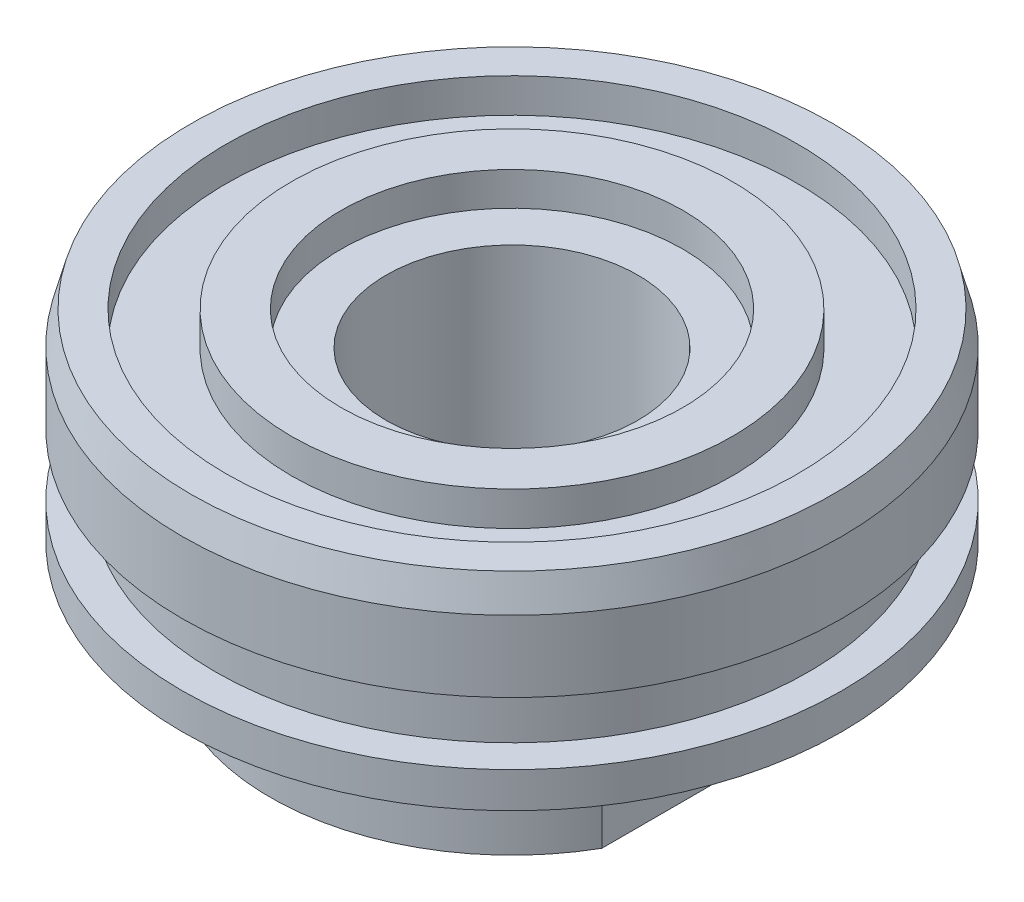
ISO-10303-21;
HEADER;
FILE_DESCRIPTION(('STEP AP214'),'2;1');
FILE_NAME('part.step','',(''),(''),'','','');
FILE_SCHEMA(('AUTOMOTIVE_DESIGN { 1 0 10303 214 1 1 1 1 }'));
ENDSEC;
DATA;
#1=APPLICATION_CONTEXT('core data for automotive mechanical design processes');
#2=APPLICATION_PROTOCOL_DEFINITION('international standard','automotive_design',2000,#1);
#3=PRODUCT_CONTEXT('',#1,'mechanical');
#4=PRODUCT('Part','Part','',(#3));
#5=PRODUCT_RELATED_PRODUCT_CATEGORY('part','',(#4));
#6=PRODUCT_DEFINITION_FORMATION('','',#4);
#7=PRODUCT_DEFINITION_CONTEXT('part definition',#1,'design');
#8=PRODUCT_DEFINITION('design','',#6,#7);
#9=PRODUCT_DEFINITION_SHAPE('','',#8);
#10=(LENGTH_UNIT() NAMED_UNIT(*) SI_UNIT(.MILLI.,.METRE.));
#11=(NAMED_UNIT(*) PLANE_ANGLE_UNIT() SI_UNIT($,.RADIAN.));
#12=(NAMED_UNIT(*) SI_UNIT($,.STERADIAN.) SOLID_ANGLE_UNIT());
#13=UNCERTAINTY_MEASURE_WITH_UNIT(LENGTH_MEASURE(1.E-05),#10,'distance_accuracy_value','');
#14=(GEOMETRIC_REPRESENTATION_CONTEXT(3) GLOBAL_UNCERTAINTY_ASSIGNED_CONTEXT((#13)) GLOBAL_UNIT_ASSIGNED_CONTEXT((#10,
#11,#12)) REPRESENTATION_CONTEXT('',''));
#15=CARTESIAN_POINT('',(0.,0.,0.));
#16=DIRECTION('',(0.,0.,1.));
#17=DIRECTION('',(1.,0.,0.));
#18=AXIS2_PLACEMENT_3D('',#15,#16,#17);
#19=CARTESIAN_POINT('',(0.,11.43,0.));
#20=DIRECTION('',(0.,-1.,0.));
#21=DIRECTION('',(0.,0.,-1.));
#22=AXIS2_PLACEMENT_3D('',#19,#20,#21);
#23=CYLINDRICAL_SURFACE('',#22,12.4714);
#24=CARTESIAN_POINT('',(0.,3.81,0.));
#25=DIRECTION('',(0.,-1.,0.));
#26=DIRECTION('',(0.,0.,-1.));
#27=AXIS2_PLACEMENT_3D('',#24,#25,#26);
#28=CIRCLE('',#27,12.4714);
#29=CARTESIAN_POINT('',(0.,3.81,-12.4714));
#30=VERTEX_POINT('',#29);
#31=EDGE_CURVE('E108',#30,#30,#28,.T.);
#32=ORIENTED_EDGE('',*,*,#31,.F.);
#33=EDGE_LOOP('',(#32));
#34=FACE_BOUND('',#33,.T.);
#35=CARTESIAN_POINT('',(0.,5.1562,0.));
#36=DIRECTION('',(0.,1.,0.));
#37=DIRECTION('',(0.,0.,1.));
#38=AXIS2_PLACEMENT_3D('',#35,#36,#37);
#39=CIRCLE('',#38,12.4714);
#40=CARTESIAN_POINT('',(0.,5.1562,12.4714));
#41=VERTEX_POINT('',#40);
#42=EDGE_CURVE('E36',#41,#41,#39,.T.);
#43=ORIENTED_EDGE('',*,*,#42,.F.);
#44=EDGE_LOOP('',(#43));
#45=FACE_BOUND('',#44,.T.);
#46=ADVANCED_FACE('F32',(#34,#45),#23,.T.);
#47=CARTESIAN_POINT('',(0.,0.,0.));
#48=DIRECTION('',(0.,1.,0.));
#49=DIRECTION('',(0.,0.,1.));
#50=AXIS2_PLACEMENT_3D('',#47,#48,#49);
#51=PLANE('',#50);
#52=CARTESIAN_POINT('',(0.,0.,0.));
#53=DIRECTION('',(0.,1.,0.));
#54=DIRECTION('',(0.,0.,1.));
#55=AXIS2_PLACEMENT_3D('',#52,#53,#54);
#56=CIRCLE('',#55,4.7625);
#57=CARTESIAN_POINT('',(0.,0.,4.7625));
#58=VERTEX_POINT('',#57);
#59=EDGE_CURVE('E131',#58,#58,#56,.T.);
#60=ORIENTED_EDGE('',*,*,#59,.T.);
#61=EDGE_LOOP('',(#60));
#62=FACE_BOUND('',#61,.T.);
#63=CARTESIAN_POINT('',(0.,0.,0.));
#64=DIRECTION('',(0.,-1.,0.));
#65=DIRECTION('',(0.,0.,-1.));
#66=AXIS2_PLACEMENT_3D('',#63,#64,#65);
#67=CIRCLE('',#66,9.144);
#68=CARTESIAN_POINT('',(-7.9375,0.,-4.53969489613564));
#69=VERTEX_POINT('',#68);
#70=CARTESIAN_POINT('',(7.9375,0.,-4.53969489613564));
#71=VERTEX_POINT('',#70);
#72=EDGE_CURVE('E95',#69,#71,#67,.T.);
#73=ORIENTED_EDGE('',*,*,#72,.T.);
#74=DIRECTION('',(0.,0.,1.));
#75=VECTOR('',#74,1.);
#76=CARTESIAN_POINT('',(7.9375,0.,0.));
#77=LINE('',#76,#75);
#78=CARTESIAN_POINT('',(7.9375,0.,4.53969489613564));
#79=VERTEX_POINT('',#78);
#80=EDGE_CURVE('E93',#71,#79,#77,.T.);
#81=ORIENTED_EDGE('',*,*,#80,.T.);
#82=CARTESIAN_POINT('',(0.,0.,0.));
#83=DIRECTION('',(0.,-1.,0.));
#84=DIRECTION('',(0.,0.,-1.));
#85=AXIS2_PLACEMENT_3D('',#82,#83,#84);
#86=CIRCLE('',#85,9.144);
#87=CARTESIAN_POINT('',(-7.9375,0.,4.53969489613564));
#88=VERTEX_POINT('',#87);
#89=EDGE_CURVE('E49',#79,#88,#86,.T.);
#90=ORIENTED_EDGE('',*,*,#89,.T.);
#91=DIRECTION('',(0.,0.,-1.));
#92=VECTOR('',#91,1.);
#93=CARTESIAN_POINT('',(-7.9375,0.,0.));
#94=LINE('',#93,#92);
#95=EDGE_CURVE('E83',#88,#69,#94,.T.);
#96=ORIENTED_EDGE('',*,*,#95,.T.);
#97=EDGE_LOOP('',(#73,#81,#90,#96));
#98=FACE_BOUND('',#97,.T.);
#99=ADVANCED_FACE('F91',(#62,#98),#51,.F.);
#100=CARTESIAN_POINT('',(0.,7.5184,0.));
#101=DIRECTION('',(0.,1.,0.));
#102=DIRECTION('',(0.,0.,1.));
#103=AXIS2_PLACEMENT_3D('',#100,#101,#102);
#104=CIRCLE('',#103,12.4714);
#105=CARTESIAN_POINT('',(0.,7.5184,12.4714));
#106=VERTEX_POINT('',#105);
#107=EDGE_CURVE('E139',#106,#106,#104,.T.);
#108=ORIENTED_EDGE('',*,*,#107,.T.);
#109=EDGE_LOOP('',(#108));
#110=FACE_BOUND('',#109,.T.);
#111=CARTESIAN_POINT('',(0.,10.2108,0.));
#112=DIRECTION('',(0.,1.,0.));
#113=DIRECTION('',(0.,0.,1.));
#114=AXIS2_PLACEMENT_3D('',#111,#112,#113);
#115=CIRCLE('',#114,12.4714);
#116=CARTESIAN_POINT('',(0.,10.2108,12.4714));
#117=VERTEX_POINT('',#116);
#118=EDGE_CURVE('E12',#117,#117,#115,.F.);
#119=ORIENTED_EDGE('',*,*,#118,.T.);
#120=EDGE_LOOP('',(#119));
#121=FACE_BOUND('',#120,.T.);
#122=ADVANCED_FACE('F34',(#110,#121),#23,.T.);
#123=CARTESIAN_POINT('',(0.,11.43,0.));
#124=DIRECTION('',(0.,-1.,0.));
#125=DIRECTION('',(0.,0.,-1.));
#126=AXIS2_PLACEMENT_3D('',#123,#124,#125);
#127=CYLINDRICAL_SURFACE('',#126,4.7625);
#128=ORIENTED_EDGE('',*,*,#59,.F.);
#129=EDGE_LOOP('',(#128));
#130=FACE_BOUND('',#129,.T.);
#131=CARTESIAN_POINT('',(0.,10.16,0.));
#132=DIRECTION('',(0.,1.,0.));
#133=DIRECTION('',(0.,0.,1.));
#134=AXIS2_PLACEMENT_3D('',#131,#132,#133);
#135=CIRCLE('',#134,4.7625);
#136=CARTESIAN_POINT('',(0.,10.16,4.7625));
#137=VERTEX_POINT('',#136);
#138=EDGE_CURVE('E118',#137,#137,#135,.T.);
#139=ORIENTED_EDGE('',*,*,#138,.T.);
#140=EDGE_LOOP('',(#139));
#141=FACE_BOUND('',#140,.T.);
#142=ADVANCED_FACE('F213',(#130,#141),#127,.F.);
#143=CARTESIAN_POINT('',(0.,11.43,0.));
#144=DIRECTION('',(0.,1.,0.));
#145=DIRECTION('',(0.,0.,1.));
#146=AXIS2_PLACEMENT_3D('',#143,#144,#145);
#147=PLANE('',#146);
#148=CARTESIAN_POINT('',(0.,11.43,0.));
#149=DIRECTION('',(0.,1.,0.));
#150=DIRECTION('',(0.,0.,1.));
#151=AXIS2_PLACEMENT_3D('',#148,#149,#150);
#152=CIRCLE('',#151,6.4643);
#153=CARTESIAN_POINT('',(0.,11.43,6.4643));
#154=VERTEX_POINT('',#153);
#155=EDGE_CURVE('E112',#154,#154,#152,.T.);
#156=ORIENTED_EDGE('',*,*,#155,.F.);
#157=EDGE_LOOP('',(#156));
#158=FACE_BOUND('',#157,.T.);
#159=CARTESIAN_POINT('',(0.,11.43,0.));
#160=DIRECTION('',(0.,1.,0.));
#161=DIRECTION('',(0.,0.,1.));
#162=AXIS2_PLACEMENT_3D('',#159,#160,#161);
#163=CIRCLE('',#162,8.3439);
#164=CARTESIAN_POINT('',(0.,11.43,8.3439));
#165=VERTEX_POINT('',#164);
#166=EDGE_CURVE('E119',#165,#165,#163,.T.);
#167=ORIENTED_EDGE('',*,*,#166,.T.);
#168=EDGE_LOOP('',(#167));
#169=FACE_BOUND('',#168,.T.);
#170=ADVANCED_FACE('F216',(#158,#169),#147,.T.);
#171=CARTESIAN_POINT('',(0.,11.43,0.));
#172=DIRECTION('',(0.,1.,0.));
#173=DIRECTION('',(0.,0.,1.));
#174=AXIS2_PLACEMENT_3D('',#171,#172,#173);
#175=CIRCLE('',#174,12.144716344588);
#176=CARTESIAN_POINT('',(0.,11.43,12.144716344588));
#177=VERTEX_POINT('',#176);
#178=EDGE_CURVE('E41',#177,#177,#175,.T.);
#179=ORIENTED_EDGE('',*,*,#178,.T.);
#180=EDGE_LOOP('',(#179));
#181=FACE_BOUND('',#180,.T.);
#182=CARTESIAN_POINT('',(0.,11.43,0.));
#183=DIRECTION('',(0.,1.,0.));
#184=DIRECTION('',(0.,0.,1.));
#185=AXIS2_PLACEMENT_3D('',#182,#183,#184);
#186=CIRCLE('',#185,10.8077);
#187=CARTESIAN_POINT('',(0.,11.43,10.8077));
#188=VERTEX_POINT('',#187);
#189=EDGE_CURVE('E125',#188,#188,#186,.T.);
#190=ORIENTED_EDGE('',*,*,#189,.F.);
#191=EDGE_LOOP('',(#190));
#192=FACE_BOUND('',#191,.T.);
#193=ADVANCED_FACE('F211',(#181,#192),#147,.T.);
#194=CARTESIAN_POINT('',(0.,10.1346,0.));
#195=DIRECTION('',(0.,1.,0.));
#196=DIRECTION('',(0.,0.,1.));
#197=AXIS2_PLACEMENT_3D('',#194,#195,#196);
#198=CYLINDRICAL_SURFACE('',#197,10.8077);
#199=CARTESIAN_POINT('',(0.,10.1346,0.));
#200=DIRECTION('',(0.,1.,0.));
#201=DIRECTION('',(0.,0.,1.));
#202=AXIS2_PLACEMENT_3D('',#199,#200,#201);
#203=CIRCLE('',#202,10.8077);
#204=CARTESIAN_POINT('',(0.,10.1346,10.8077));
#205=VERTEX_POINT('',#204);
#206=EDGE_CURVE('E128',#205,#205,#203,.T.);
#207=ORIENTED_EDGE('',*,*,#206,.F.);
#208=EDGE_LOOP('',(#207));
#209=FACE_BOUND('',#208,.T.);
#210=ORIENTED_EDGE('',*,*,#189,.T.);
#211=EDGE_LOOP('',(#210));
#212=FACE_BOUND('',#211,.T.);
#213=ADVANCED_FACE('F207',(#209,#212),#198,.F.);
#214=CARTESIAN_POINT('',(0.,10.1346,0.));
#215=DIRECTION('',(0.,1.,0.));
#216=DIRECTION('',(0.,0.,1.));
#217=AXIS2_PLACEMENT_3D('',#214,#215,#216);
#218=PLANE('',#217);
#219=CARTESIAN_POINT('',(0.,10.1346,0.));
#220=DIRECTION('',(0.,1.,0.));
#221=DIRECTION('',(0.,0.,1.));
#222=AXIS2_PLACEMENT_3D('',#219,#220,#221);
#223=CIRCLE('',#222,8.3439);
#224=CARTESIAN_POINT('',(0.,10.1346,8.3439));
#225=VERTEX_POINT('',#224);
#226=EDGE_CURVE('E122',#225,#225,#223,.T.);
#227=ORIENTED_EDGE('',*,*,#226,.F.);
#228=EDGE_LOOP('',(#227));
#229=FACE_BOUND('',#228,.T.);
#230=ORIENTED_EDGE('',*,*,#206,.T.);
#231=EDGE_LOOP('',(#230));
#232=FACE_BOUND('',#231,.T.);
#233=ADVANCED_FACE('F203',(#229,#232),#218,.T.);
#234=CARTESIAN_POINT('',(0.,10.1346,0.));
#235=DIRECTION('',(0.,1.,0.));
#236=DIRECTION('',(0.,0.,1.));
#237=AXIS2_PLACEMENT_3D('',#234,#235,#236);
#238=CYLINDRICAL_SURFACE('',#237,8.3439);
#239=ORIENTED_EDGE('',*,*,#226,.T.);
#240=EDGE_LOOP('',(#239));
#241=FACE_BOUND('',#240,.T.);
#242=ORIENTED_EDGE('',*,*,#166,.F.);
#243=EDGE_LOOP('',(#242));
#244=FACE_BOUND('',#243,.T.);
#245=ADVANCED_FACE('F199',(#241,#244),#238,.T.);
#246=CARTESIAN_POINT('',(0.,10.16,0.));
#247=DIRECTION('',(0.,1.,0.));
#248=DIRECTION('',(0.,0.,1.));
#249=AXIS2_PLACEMENT_3D('',#246,#247,#248);
#250=CYLINDRICAL_SURFACE('',#249,6.4643);
#251=CARTESIAN_POINT('',(0.,10.16,0.));
#252=DIRECTION('',(0.,1.,0.));
#253=DIRECTION('',(0.,0.,1.));
#254=AXIS2_PLACEMENT_3D('',#251,#252,#253);
#255=CIRCLE('',#254,6.4643);
#256=CARTESIAN_POINT('',(0.,10.16,6.4643));
#257=VERTEX_POINT('',#256);
#258=EDGE_CURVE('E115',#257,#257,#255,.T.);
#259=ORIENTED_EDGE('',*,*,#258,.F.);
#260=EDGE_LOOP('',(#259));
#261=FACE_BOUND('',#260,.T.);
#262=ORIENTED_EDGE('',*,*,#155,.T.);
#263=EDGE_LOOP('',(#262));
#264=FACE_BOUND('',#263,.T.);
#265=ADVANCED_FACE('F195',(#261,#264),#250,.F.);
#266=CARTESIAN_POINT('',(0.,10.16,0.));
#267=DIRECTION('',(0.,1.,0.));
#268=DIRECTION('',(0.,0.,1.));
#269=AXIS2_PLACEMENT_3D('',#266,#267,#268);
#270=PLANE('',#269);
#271=ORIENTED_EDGE('',*,*,#138,.F.);
#272=EDGE_LOOP('',(#271));
#273=FACE_BOUND('',#272,.T.);
#274=ORIENTED_EDGE('',*,*,#258,.T.);
#275=EDGE_LOOP('',(#274));
#276=FACE_BOUND('',#275,.T.);
#277=ADVANCED_FACE('F191',(#273,#276),#270,.T.);
#278=CARTESIAN_POINT('',(0.,11.43,0.));
#279=DIRECTION('',(0.,-1.,0.));
#280=DIRECTION('',(0.,0.,-1.));
#281=AXIS2_PLACEMENT_3D('',#278,#279,#280);
#282=CONICAL_SURFACE('',#281,12.144716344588,0.261799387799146);
#283=ORIENTED_EDGE('',*,*,#118,.F.);
#284=EDGE_LOOP('',(#283));
#285=FACE_BOUND('',#284,.T.);
#286=ORIENTED_EDGE('',*,*,#178,.F.);
#287=EDGE_LOOP('',(#286));
#288=FACE_BOUND('',#287,.T.);
#289=ADVANCED_FACE('F160',(#285,#288),#282,.T.);
#290=CARTESIAN_POINT('',(0.,3.81,0.));
#291=DIRECTION('',(0.,-1.,0.));
#292=DIRECTION('',(0.,0.,-1.));
#293=AXIS2_PLACEMENT_3D('',#290,#291,#292);
#294=PLANE('',#293);
#295=DIRECTION('',(0.,0.,-1.));
#296=VECTOR('',#295,1.);
#297=CARTESIAN_POINT('',(-7.9375,3.81,0.));
#298=LINE('',#297,#296);
#299=CARTESIAN_POINT('',(-7.9375,3.81,4.53969489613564));
#300=VERTEX_POINT('',#299);
#301=CARTESIAN_POINT('',(-7.9375,3.81,-4.53969489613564));
#302=VERTEX_POINT('',#301);
#303=EDGE_CURVE('E105',#300,#302,#298,.T.);
#304=ORIENTED_EDGE('',*,*,#303,.F.);
#305=CARTESIAN_POINT('',(0.,3.81,0.));
#306=DIRECTION('',(0.,-1.,0.));
#307=DIRECTION('',(0.,0.,-1.));
#308=AXIS2_PLACEMENT_3D('',#305,#306,#307);
#309=CIRCLE('',#308,9.144);
#310=CARTESIAN_POINT('',(7.9375,3.81,4.53969489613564));
#311=VERTEX_POINT('',#310);
#312=EDGE_CURVE('E57',#311,#300,#309,.T.);
#313=ORIENTED_EDGE('',*,*,#312,.F.);
#314=DIRECTION('',(0.,0.,1.));
#315=VECTOR('',#314,1.);
#316=CARTESIAN_POINT('',(7.9375,3.81,0.));
#317=LINE('',#316,#315);
#318=CARTESIAN_POINT('',(7.9375,3.81,-4.53969489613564));
#319=VERTEX_POINT('',#318);
#320=EDGE_CURVE('E101',#319,#311,#317,.T.);
#321=ORIENTED_EDGE('',*,*,#320,.F.);
#322=CARTESIAN_POINT('',(0.,3.81,0.));
#323=DIRECTION('',(0.,-1.,0.));
#324=DIRECTION('',(0.,0.,-1.));
#325=AXIS2_PLACEMENT_3D('',#322,#323,#324);
#326=CIRCLE('',#325,9.144);
#327=EDGE_CURVE('E88',#302,#319,#326,.T.);
#328=ORIENTED_EDGE('',*,*,#327,.F.);
#329=EDGE_LOOP('',(#304,#313,#321,#328));
#330=FACE_BOUND('',#329,.T.);
#331=ORIENTED_EDGE('',*,*,#31,.T.);
#332=EDGE_LOOP('',(#331));
#333=FACE_BOUND('',#332,.T.);
#334=ADVANCED_FACE('F157',(#330,#333),#294,.T.);
#335=CARTESIAN_POINT('',(0.,3.81,0.));
#336=DIRECTION('',(0.,-1.,0.));
#337=DIRECTION('',(0.,0.,-1.));
#338=AXIS2_PLACEMENT_3D('',#335,#336,#337);
#339=CYLINDRICAL_SURFACE('',#338,9.144);
#340=ORIENTED_EDGE('',*,*,#72,.F.);
#341=DIRECTION('',(0.,-1.,0.));
#342=VECTOR('',#341,1.);
#343=CARTESIAN_POINT('',(-7.9375,3.81,-4.53969489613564));
#344=LINE('',#343,#342);
#345=EDGE_CURVE('E79',#302,#69,#344,.T.);
#346=ORIENTED_EDGE('',*,*,#345,.F.);
#347=ORIENTED_EDGE('',*,*,#327,.T.);
#348=DIRECTION('',(0.,-1.,0.));
#349=VECTOR('',#348,1.);
#350=CARTESIAN_POINT('',(7.9375,3.81,-4.53969489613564));
#351=LINE('',#350,#349);
#352=EDGE_CURVE('E107',#319,#71,#351,.T.);
#353=ORIENTED_EDGE('',*,*,#352,.T.);
#354=EDGE_LOOP('',(#340,#346,#347,#353));
#355=FACE_BOUND('',#354,.T.);
#356=ADVANCED_FACE('F153',(#355),#339,.T.);
#357=CARTESIAN_POINT('',(-7.9375,3.81,0.));
#358=DIRECTION('',(-1.,0.,0.));
#359=DIRECTION('',(0.,0.,1.));
#360=AXIS2_PLACEMENT_3D('',#357,#358,#359);
#361=PLANE('',#360);
#362=ORIENTED_EDGE('',*,*,#95,.F.);
#363=DIRECTION('',(0.,-1.,0.));
#364=VECTOR('',#363,1.);
#365=CARTESIAN_POINT('',(-7.9375,3.81,4.53969489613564));
#366=LINE('',#365,#364);
#367=EDGE_CURVE('E74',#300,#88,#366,.T.);
#368=ORIENTED_EDGE('',*,*,#367,.F.);
#369=ORIENTED_EDGE('',*,*,#303,.T.);
#370=ORIENTED_EDGE('',*,*,#345,.T.);
#371=EDGE_LOOP('',(#362,#368,#369,#370));
#372=FACE_BOUND('',#371,.T.);
#373=ADVANCED_FACE('F84',(#372),#361,.T.);
#374=CARTESIAN_POINT('',(0.,3.81,0.));
#375=DIRECTION('',(0.,-1.,0.));
#376=DIRECTION('',(0.,0.,-1.));
#377=AXIS2_PLACEMENT_3D('',#374,#375,#376);
#378=CYLINDRICAL_SURFACE('',#377,9.144);
#379=ORIENTED_EDGE('',*,*,#89,.F.);
#380=DIRECTION('',(0.,-1.,0.));
#381=VECTOR('',#380,1.);
#382=CARTESIAN_POINT('',(7.9375,3.81,4.53969489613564));
#383=LINE('',#382,#381);
#384=EDGE_CURVE('E80',#311,#79,#383,.T.);
#385=ORIENTED_EDGE('',*,*,#384,.F.);
#386=ORIENTED_EDGE('',*,*,#312,.T.);
#387=ORIENTED_EDGE('',*,*,#367,.T.);
#388=EDGE_LOOP('',(#379,#385,#386,#387));
#389=FACE_BOUND('',#388,.T.);
#390=ADVANCED_FACE('F76',(#389),#378,.T.);
#391=CARTESIAN_POINT('',(7.9375,3.81,0.));
#392=DIRECTION('',(1.,0.,0.));
#393=DIRECTION('',(0.,0.,-1.));
#394=AXIS2_PLACEMENT_3D('',#391,#392,#393);
#395=PLANE('',#394);
#396=ORIENTED_EDGE('',*,*,#80,.F.);
#397=ORIENTED_EDGE('',*,*,#352,.F.);
#398=ORIENTED_EDGE('',*,*,#320,.T.);
#399=ORIENTED_EDGE('',*,*,#384,.T.);
#400=EDGE_LOOP('',(#396,#397,#398,#399));
#401=FACE_BOUND('',#400,.T.);
#402=ADVANCED_FACE('F156',(#401),#395,.T.);
#403=CARTESIAN_POINT('',(0.,5.1562,0.));
#404=DIRECTION('',(0.,1.,0.));
#405=DIRECTION('',(0.,0.,1.));
#406=AXIS2_PLACEMENT_3D('',#403,#404,#405);
#407=PLANE('',#406);
#408=CARTESIAN_POINT('',(0.,5.1562,0.));
#409=DIRECTION('',(0.,1.,0.));
#410=DIRECTION('',(0.,0.,1.));
#411=AXIS2_PLACEMENT_3D('',#408,#409,#410);
#412=CIRCLE('',#411,11.2268);
#413=CARTESIAN_POINT('',(0.,5.1562,11.2268));
#414=VERTEX_POINT('',#413);
#415=EDGE_CURVE('E141',#414,#414,#412,.T.);
#416=ORIENTED_EDGE('',*,*,#415,.F.);
#417=EDGE_LOOP('',(#416));
#418=FACE_BOUND('',#417,.T.);
#419=ORIENTED_EDGE('',*,*,#42,.T.);
#420=EDGE_LOOP('',(#419));
#421=FACE_BOUND('',#420,.T.);
#422=ADVANCED_FACE('F168',(#418,#421),#407,.T.);
#423=CARTESIAN_POINT('',(0.,7.5184,0.));
#424=DIRECTION('',(0.,1.,0.));
#425=DIRECTION('',(0.,0.,1.));
#426=AXIS2_PLACEMENT_3D('',#423,#424,#425);
#427=PLANE('',#426);
#428=CARTESIAN_POINT('',(0.,7.5184,0.));
#429=DIRECTION('',(0.,1.,0.));
#430=DIRECTION('',(0.,0.,1.));
#431=AXIS2_PLACEMENT_3D('',#428,#429,#430);
#432=CIRCLE('',#431,11.2268);
#433=CARTESIAN_POINT('',(0.,7.5184,11.2268));
#434=VERTEX_POINT('',#433);
#435=EDGE_CURVE('E146',#434,#434,#432,.T.);
#436=ORIENTED_EDGE('',*,*,#435,.T.);
#437=EDGE_LOOP('',(#436));
#438=FACE_BOUND('',#437,.T.);
#439=ORIENTED_EDGE('',*,*,#107,.F.);
#440=EDGE_LOOP('',(#439));
#441=FACE_BOUND('',#440,.T.);
#442=ADVANCED_FACE('F170',(#438,#441),#427,.F.);
#443=CARTESIAN_POINT('',(0.,5.1562,0.));
#444=DIRECTION('',(0.,1.,0.));
#445=DIRECTION('',(0.,0.,1.));
#446=AXIS2_PLACEMENT_3D('',#443,#444,#445);
#447=CYLINDRICAL_SURFACE('',#446,11.2268);
#448=ORIENTED_EDGE('',*,*,#415,.T.);
#449=EDGE_LOOP('',(#448));
#450=FACE_BOUND('',#449,.T.);
#451=ORIENTED_EDGE('',*,*,#435,.F.);
#452=EDGE_LOOP('',(#451));
#453=FACE_BOUND('',#452,.T.);
#454=ADVANCED_FACE('F177',(#450,#453),#447,.T.);
#455=CLOSED_SHELL('',(#46,#99,#122,#142,#170,#193,#213,#233,#245,#265,#277,#289,#334,#356,#373,
#390,#402,#422,#442,#454));
#456=MANIFOLD_SOLID_BREP('B2',#455);
#457=ADVANCED_BREP_SHAPE_REPRESENTATION('',(#18,#456),#14);
#458=SHAPE_DEFINITION_REPRESENTATION(#9,#457);
ENDSEC;
END-ISO-10303-21;
